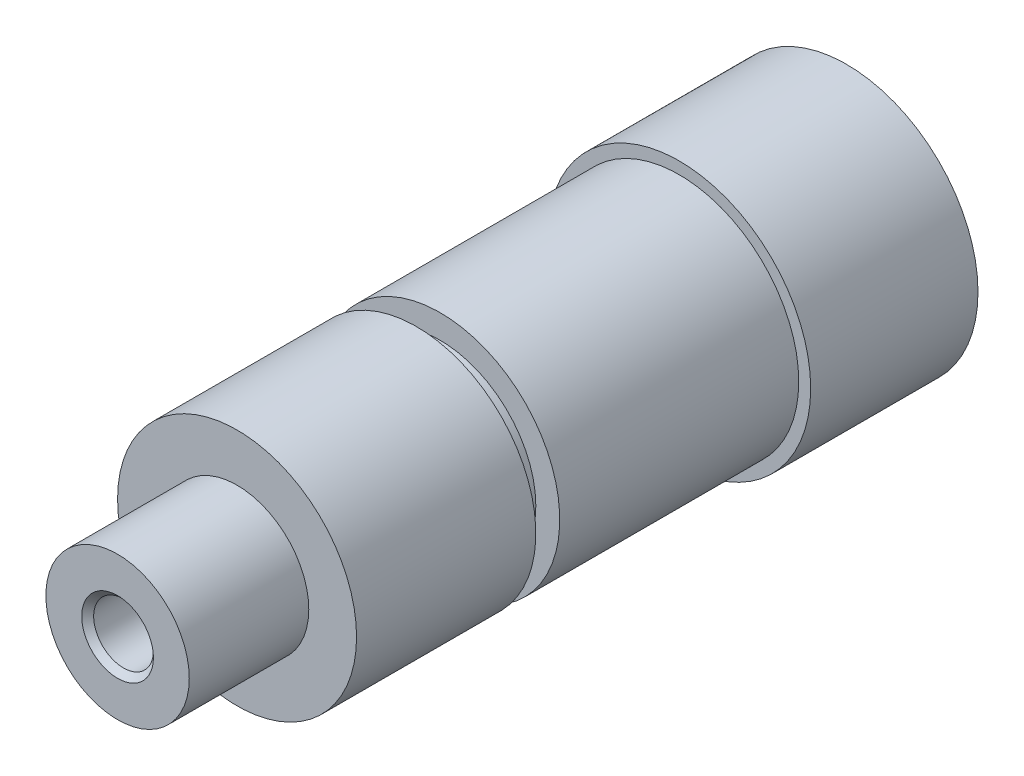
from build123d import *

# Parameters (mm, degrees)
ESQUISSE1_R                     = 11
BASE_EXTRUSION_DEPTH            = 14
ESQUISSE2_R                     = 10
BOSS_EXTRU_1_DEPTH              = 37
ESQUISSE3_W                     = 2
ESQUISSE3_H                     = 2
ESQUISSE4_R                     = 6
BOSS_EXTRU_2_DEPTH              = 10
TROU_TARAUD_M6X1_01_D           = 5
TROU_TARAUD_M6X1_01_DEPTH       = 19
TROU_TARAUD_M6X1_01_CSINK_D     = 6
TROU_TARAUD_M6X1_01_CSINK_ANGLE = 90
TROU_TARAUD_M6X1_01_TIP         = 1.502151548


with BuildPart() as part:
    # Esquisse1 → Base-Extrusion (new body)
    with BuildSketch(Plane.XY):
        Circle(ESQUISSE1_R)
    extrude(amount=BASE_EXTRUSION_DEPTH)

    # Esquisse2 → Boss.-Extru.1 (add)
    with BuildSketch(Plane.XY.offset(14)):
        Circle(ESQUISSE2_R)
    extrude(amount=BOSS_EXTRU_1_DEPTH)

    # Esquisse3 → Enl_vement de mati_re-R_volution1 (revolve, cut)
    with BuildSketch(Plane(origin=(0, 0, 0), x_dir=(1, 0, 0), z_dir=(0, 1, 0)), mode=Mode.PRIVATE) as enl_vement_de_mati_re_r_volution1_sk:
        with Locations((9, -35)):
            Rectangle(ESQUISSE3_W, ESQUISSE3_H)
    revolve(enl_vement_de_mati_re_r_volution1_sk.sketch.rotate(Axis((0, 0, 0), (0, 0, 1)), 180), axis=Axis((0, 0, 0), (0, 0, 1)), mode=Mode.SUBTRACT)

    # Esquisse4 → Boss.-Extru.2 (add)
    with BuildSketch(Plane.XY.offset(51)):
        Circle(ESQUISSE4_R)
    extrude(amount=BOSS_EXTRU_2_DEPTH)

    # Trou taraud_ M6x1.01
    with Locations(Plane.XY.offset(61)):
        with Locations((0, 0)):
            CounterSinkHole(TROU_TARAUD_M6X1_01_D / 2, TROU_TARAUD_M6X1_01_CSINK_D / 2, depth=TROU_TARAUD_M6X1_01_DEPTH, counter_sink_angle=TROU_TARAUD_M6X1_01_CSINK_ANGLE)
            with Locations((0, 0, -(TROU_TARAUD_M6X1_01_DEPTH + TROU_TARAUD_M6X1_01_TIP / 2))):  # 118° drill point
                Cone(0, TROU_TARAUD_M6X1_01_D / 2, TROU_TARAUD_M6X1_01_TIP, mode=Mode.SUBTRACT)


solid = part.part
